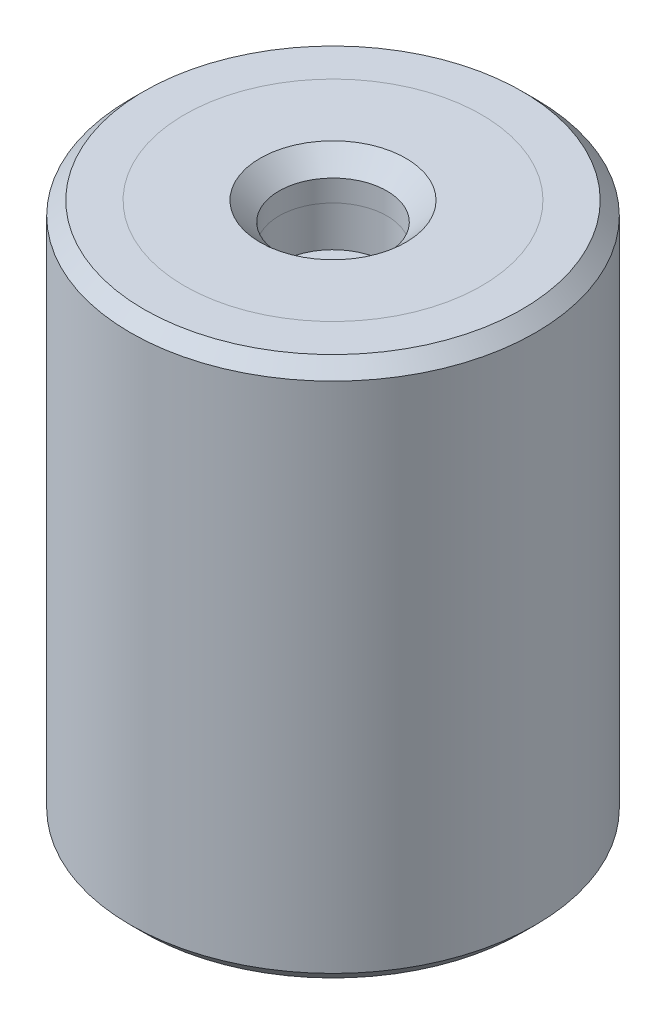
ISO-10303-21;
HEADER;
FILE_DESCRIPTION(('STEP AP214'),'2;1');
FILE_NAME('part.step','',(''),(''),'','','');
FILE_SCHEMA(('AUTOMOTIVE_DESIGN { 1 0 10303 214 1 1 1 1 }'));
ENDSEC;
DATA;
#1=APPLICATION_CONTEXT('core data for automotive mechanical design processes');
#2=APPLICATION_PROTOCOL_DEFINITION('international standard','automotive_design',2000,#1);
#3=PRODUCT_CONTEXT('',#1,'mechanical');
#4=PRODUCT('Part','Part','',(#3));
#5=PRODUCT_RELATED_PRODUCT_CATEGORY('part','',(#4));
#6=PRODUCT_DEFINITION_FORMATION('','',#4);
#7=PRODUCT_DEFINITION_CONTEXT('part definition',#1,'design');
#8=PRODUCT_DEFINITION('design','',#6,#7);
#9=PRODUCT_DEFINITION_SHAPE('','',#8);
#10=(LENGTH_UNIT() NAMED_UNIT(*) SI_UNIT(.MILLI.,.METRE.));
#11=(NAMED_UNIT(*) PLANE_ANGLE_UNIT() SI_UNIT($,.RADIAN.));
#12=(NAMED_UNIT(*) SI_UNIT($,.STERADIAN.) SOLID_ANGLE_UNIT());
#13=UNCERTAINTY_MEASURE_WITH_UNIT(LENGTH_MEASURE(1.E-05),#10,'distance_accuracy_value','');
#14=(GEOMETRIC_REPRESENTATION_CONTEXT(3) GLOBAL_UNCERTAINTY_ASSIGNED_CONTEXT((#13)) GLOBAL_UNIT_ASSIGNED_CONTEXT((#10,
#11,#12)) REPRESENTATION_CONTEXT('',''));
#15=CARTESIAN_POINT('',(0.,0.,0.));
#16=DIRECTION('',(0.,0.,1.));
#17=DIRECTION('',(1.,0.,0.));
#18=AXIS2_PLACEMENT_3D('',#15,#16,#17);
#19=CARTESIAN_POINT('',(0.,51.0340428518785,0.));
#20=DIRECTION('',(0.,1.,0.));
#21=DIRECTION('',(0.,0.,1.));
#22=AXIS2_PLACEMENT_3D('',#19,#20,#21);
#23=CYLINDRICAL_SURFACE('',#22,2.);
#24=CARTESIAN_POINT('',(0.,-17.8,0.));
#25=DIRECTION('',(0.,-1.,0.));
#26=DIRECTION('',(0.,0.,-1.));
#27=AXIS2_PLACEMENT_3D('',#24,#25,#26);
#28=CIRCLE('',#27,2.);
#29=CARTESIAN_POINT('',(0.,-17.8,-2.));
#30=VERTEX_POINT('',#29);
#31=EDGE_CURVE('P0_E10',#30,#30,#28,.T.);
#32=ORIENTED_EDGE('',*,*,#31,.T.);
#33=EDGE_LOOP('',(#32));
#34=FACE_BOUND('',#33,.T.);
#35=CARTESIAN_POINT('',(0.,-17.,0.));
#36=DIRECTION('',(0.,1.,0.));
#37=DIRECTION('',(0.,0.,1.));
#38=AXIS2_PLACEMENT_3D('',#35,#36,#37);
#39=CIRCLE('',#38,2.);
#40=CARTESIAN_POINT('',(0.,-17.,2.));
#41=VERTEX_POINT('',#40);
#42=EDGE_CURVE('P0_E25',#41,#41,#39,.T.);
#43=ORIENTED_EDGE('',*,*,#42,.T.);
#44=EDGE_LOOP('',(#43));
#45=FACE_BOUND('',#44,.T.);
#46=ADVANCED_FACE('P0_F14',(#34,#45),#23,.F.);
#47=CARTESIAN_POINT('',(0.,-17.,2.));
#48=DIRECTION('',(0.,1.,0.));
#49=DIRECTION('',(0.,0.,1.));
#50=AXIS2_PLACEMENT_3D('',#47,#48,#49);
#51=PLANE('',#50);
#52=CARTESIAN_POINT('',(0.,-17.,0.));
#53=DIRECTION('',(0.,1.,0.));
#54=DIRECTION('',(0.,0.,1.));
#55=AXIS2_PLACEMENT_3D('',#52,#53,#54);
#56=CIRCLE('',#55,5.5);
#57=CARTESIAN_POINT('',(0.,-17.,5.5));
#58=VERTEX_POINT('',#57);
#59=EDGE_CURVE('P0_E29',#58,#58,#56,.T.);
#60=ORIENTED_EDGE('',*,*,#59,.T.);
#61=EDGE_LOOP('',(#60));
#62=FACE_BOUND('',#61,.T.);
#63=ORIENTED_EDGE('',*,*,#42,.F.);
#64=EDGE_LOOP('',(#63));
#65=FACE_BOUND('',#64,.T.);
#66=ADVANCED_FACE('P0_F50',(#62,#65),#51,.T.);
#67=CARTESIAN_POINT('',(0.,51.0340428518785,0.));
#68=DIRECTION('',(0.,1.,0.));
#69=DIRECTION('',(0.,0.,1.));
#70=AXIS2_PLACEMENT_3D('',#67,#68,#69);
#71=CYLINDRICAL_SURFACE('',#70,5.5);
#72=CARTESIAN_POINT('',(0.,-18.5,0.));
#73=DIRECTION('',(0.,1.,0.));
#74=DIRECTION('',(0.,0.,1.));
#75=AXIS2_PLACEMENT_3D('',#72,#73,#74);
#76=CIRCLE('',#75,5.5);
#77=CARTESIAN_POINT('',(0.,-18.5,5.5));
#78=VERTEX_POINT('',#77);
#79=EDGE_CURVE('P0_E34',#78,#78,#76,.T.);
#80=ORIENTED_EDGE('',*,*,#79,.T.);
#81=EDGE_LOOP('',(#80));
#82=FACE_BOUND('',#81,.T.);
#83=ORIENTED_EDGE('',*,*,#59,.F.);
#84=EDGE_LOOP('',(#83));
#85=FACE_BOUND('',#84,.T.);
#86=ADVANCED_FACE('P0_F38',(#82,#85),#71,.T.);
#87=CARTESIAN_POINT('',(0.,-18.5,5.5));
#88=DIRECTION('',(0.,-1.,0.));
#89=DIRECTION('',(0.,0.,-1.));
#90=AXIS2_PLACEMENT_3D('',#87,#88,#89);
#91=PLANE('',#90);
#92=CARTESIAN_POINT('',(0.,-18.5,0.));
#93=DIRECTION('',(0.,-1.,0.));
#94=DIRECTION('',(0.,0.,-1.));
#95=AXIS2_PLACEMENT_3D('',#92,#93,#94);
#96=CIRCLE('',#95,2.7);
#97=CARTESIAN_POINT('',(0.,-18.5,-2.7));
#98=VERTEX_POINT('',#97);
#99=EDGE_CURVE('P0_E21',#98,#98,#96,.F.);
#100=ORIENTED_EDGE('',*,*,#99,.T.);
#101=EDGE_LOOP('',(#100));
#102=FACE_BOUND('',#101,.T.);
#103=ORIENTED_EDGE('',*,*,#79,.F.);
#104=EDGE_LOOP('',(#103));
#105=FACE_BOUND('',#104,.T.);
#106=ADVANCED_FACE('P0_F41',(#102,#105),#91,.T.);
#107=CARTESIAN_POINT('',(0.,-18.5,0.));
#108=DIRECTION('',(0.,-1.,0.));
#109=DIRECTION('',(0.,0.,-1.));
#110=AXIS2_PLACEMENT_3D('',#107,#108,#109);
#111=CONICAL_SURFACE('',#110,2.7,0.785398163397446);
#112=ORIENTED_EDGE('',*,*,#31,.F.);
#113=EDGE_LOOP('',(#112));
#114=FACE_BOUND('',#113,.T.);
#115=ORIENTED_EDGE('',*,*,#99,.F.);
#116=EDGE_LOOP('',(#115));
#117=FACE_BOUND('',#116,.T.);
#118=ADVANCED_FACE('P0_F16',(#114,#117),#111,.F.);
#119=CLOSED_SHELL('',(#46,#66,#86,#106,#118));
#120=MANIFOLD_SOLID_BREP('P0_B1',#119);
#121=CARTESIAN_POINT('',(0.,69.5340428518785,0.));
#122=DIRECTION('',(0.,1.,0.));
#123=DIRECTION('',(0.,0.,1.));
#124=AXIS2_PLACEMENT_3D('',#121,#122,#123);
#125=CYLINDRICAL_SURFACE('',#124,2.);
#126=CARTESIAN_POINT('',(0.,0.800000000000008,0.));
#127=DIRECTION('',(0.,1.,0.));
#128=DIRECTION('',(0.,0.,1.));
#129=AXIS2_PLACEMENT_3D('',#126,#127,#128);
#130=CIRCLE('',#129,2.);
#131=CARTESIAN_POINT('',(0.,0.800000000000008,2.));
#132=VERTEX_POINT('',#131);
#133=EDGE_CURVE('P1_E21',#132,#132,#130,.T.);
#134=ORIENTED_EDGE('',*,*,#133,.T.);
#135=EDGE_LOOP('',(#134));
#136=FACE_BOUND('',#135,.T.);
#137=CARTESIAN_POINT('',(0.,0.,0.));
#138=DIRECTION('',(0.,1.,0.));
#139=DIRECTION('',(0.,0.,1.));
#140=AXIS2_PLACEMENT_3D('',#137,#138,#139);
#141=CIRCLE('',#140,2.);
#142=CARTESIAN_POINT('',(0.,0.,2.));
#143=VERTEX_POINT('',#142);
#144=EDGE_CURVE('P1_E34',#143,#143,#141,.T.);
#145=ORIENTED_EDGE('',*,*,#144,.F.);
#146=EDGE_LOOP('',(#145));
#147=FACE_BOUND('',#146,.T.);
#148=ADVANCED_FACE('P1_F14',(#136,#147),#125,.F.);
#149=CARTESIAN_POINT('',(0.,1.5,2.));
#150=DIRECTION('',(0.,1.,0.));
#151=DIRECTION('',(0.,0.,1.));
#152=AXIS2_PLACEMENT_3D('',#149,#150,#151);
#153=PLANE('',#152);
#154=CARTESIAN_POINT('',(0.,1.5,0.));
#155=DIRECTION('',(0.,1.,0.));
#156=DIRECTION('',(0.,0.,1.));
#157=AXIS2_PLACEMENT_3D('',#154,#155,#156);
#158=CIRCLE('',#157,2.7);
#159=CARTESIAN_POINT('',(0.,1.5,2.7));
#160=VERTEX_POINT('',#159);
#161=EDGE_CURVE('P1_E10',#160,#160,#158,.F.);
#162=ORIENTED_EDGE('',*,*,#161,.T.);
#163=EDGE_LOOP('',(#162));
#164=FACE_BOUND('',#163,.T.);
#165=CARTESIAN_POINT('',(0.,1.5,0.));
#166=DIRECTION('',(0.,1.,0.));
#167=DIRECTION('',(0.,0.,1.));
#168=AXIS2_PLACEMENT_3D('',#165,#166,#167);
#169=CIRCLE('',#168,5.5);
#170=CARTESIAN_POINT('',(0.,1.5,5.5));
#171=VERTEX_POINT('',#170);
#172=EDGE_CURVE('P1_E25',#171,#171,#169,.T.);
#173=ORIENTED_EDGE('',*,*,#172,.T.);
#174=EDGE_LOOP('',(#173));
#175=FACE_BOUND('',#174,.T.);
#176=ADVANCED_FACE('P1_F42',(#164,#175),#153,.T.);
#177=CARTESIAN_POINT('',(0.,69.5340428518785,0.));
#178=DIRECTION('',(0.,1.,0.));
#179=DIRECTION('',(0.,0.,1.));
#180=AXIS2_PLACEMENT_3D('',#177,#178,#179);
#181=CYLINDRICAL_SURFACE('',#180,5.5);
#182=CARTESIAN_POINT('',(0.,0.,0.));
#183=DIRECTION('',(0.,1.,0.));
#184=DIRECTION('',(0.,0.,1.));
#185=AXIS2_PLACEMENT_3D('',#182,#183,#184);
#186=CIRCLE('',#185,5.5);
#187=CARTESIAN_POINT('',(0.,0.,5.5));
#188=VERTEX_POINT('',#187);
#189=EDGE_CURVE('P1_E29',#188,#188,#186,.T.);
#190=ORIENTED_EDGE('',*,*,#189,.T.);
#191=EDGE_LOOP('',(#190));
#192=FACE_BOUND('',#191,.T.);
#193=ORIENTED_EDGE('',*,*,#172,.F.);
#194=EDGE_LOOP('',(#193));
#195=FACE_BOUND('',#194,.T.);
#196=ADVANCED_FACE('P1_F47',(#192,#195),#181,.T.);
#197=CARTESIAN_POINT('',(0.,0.,5.5));
#198=DIRECTION('',(0.,-1.,0.));
#199=DIRECTION('',(0.,0.,-1.));
#200=AXIS2_PLACEMENT_3D('',#197,#198,#199);
#201=PLANE('',#200);
#202=ORIENTED_EDGE('',*,*,#144,.T.);
#203=EDGE_LOOP('',(#202));
#204=FACE_BOUND('',#203,.T.);
#205=ORIENTED_EDGE('',*,*,#189,.F.);
#206=EDGE_LOOP('',(#205));
#207=FACE_BOUND('',#206,.T.);
#208=ADVANCED_FACE('P1_F38',(#204,#207),#201,.T.);
#209=CARTESIAN_POINT('',(0.,0.800000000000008,0.));
#210=DIRECTION('',(0.,1.,0.));
#211=DIRECTION('',(0.,0.,1.));
#212=AXIS2_PLACEMENT_3D('',#209,#210,#211);
#213=CONICAL_SURFACE('',#212,2.,0.785398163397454);
#214=ORIENTED_EDGE('',*,*,#161,.F.);
#215=EDGE_LOOP('',(#214));
#216=FACE_BOUND('',#215,.T.);
#217=ORIENTED_EDGE('',*,*,#133,.F.);
#218=EDGE_LOOP('',(#217));
#219=FACE_BOUND('',#218,.T.);
#220=ADVANCED_FACE('P1_F16',(#216,#219),#213,.F.);
#221=CLOSED_SHELL('',(#148,#176,#196,#208,#220));
#222=MANIFOLD_SOLID_BREP('P1_B1',#221);
#223=CARTESIAN_POINT('',(0.,0.,0.));
#224=DIRECTION('',(0.,1.,0.));
#225=DIRECTION('',(0.,0.,1.));
#226=AXIS2_PLACEMENT_3D('',#223,#224,#225);
#227=PLANE('',#226);
#228=CARTESIAN_POINT('',(0.,0.,0.));
#229=DIRECTION('',(0.,1.,0.));
#230=DIRECTION('',(0.,0.,1.));
#231=AXIS2_PLACEMENT_3D('',#228,#229,#230);
#232=CIRCLE('',#231,2.);
#233=CARTESIAN_POINT('',(0.,0.,2.));
#234=VERTEX_POINT('',#233);
#235=EDGE_CURVE('P2_E46',#234,#234,#232,.T.);
#236=ORIENTED_EDGE('',*,*,#235,.F.);
#237=EDGE_LOOP('',(#236));
#238=FACE_BOUND('',#237,.T.);
#239=CARTESIAN_POINT('',(0.,0.,0.));
#240=DIRECTION('',(0.,1.,0.));
#241=DIRECTION('',(0.,0.,1.));
#242=AXIS2_PLACEMENT_3D('',#239,#240,#241);
#243=CIRCLE('',#242,5.5);
#244=CARTESIAN_POINT('',(0.,0.,5.5));
#245=VERTEX_POINT('',#244);
#246=EDGE_CURVE('P2_E33',#245,#245,#243,.T.);
#247=ORIENTED_EDGE('',*,*,#246,.T.);
#248=EDGE_LOOP('',(#247));
#249=FACE_BOUND('',#248,.T.);
#250=ADVANCED_FACE('P2_F13',(#238,#249),#227,.T.);
#251=CARTESIAN_POINT('',(0.,65.5134936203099,0.));
#252=DIRECTION('',(0.,1.,0.));
#253=DIRECTION('',(0.,0.,1.));
#254=AXIS2_PLACEMENT_3D('',#251,#252,#253);
#255=CYLINDRICAL_SURFACE('',#254,5.5);
#256=CARTESIAN_POINT('',(0.,1.5,0.));
#257=DIRECTION('',(0.,1.,0.));
#258=DIRECTION('',(0.,0.,1.));
#259=AXIS2_PLACEMENT_3D('',#256,#257,#258);
#260=CIRCLE('',#259,5.5);
#261=CARTESIAN_POINT('',(0.,1.5,5.5));
#262=VERTEX_POINT('',#261);
#263=EDGE_CURVE('P2_E36',#262,#262,#260,.T.);
#264=ORIENTED_EDGE('',*,*,#263,.T.);
#265=EDGE_LOOP('',(#264));
#266=FACE_BOUND('',#265,.T.);
#267=ORIENTED_EDGE('',*,*,#246,.F.);
#268=EDGE_LOOP('',(#267));
#269=FACE_BOUND('',#268,.T.);
#270=ADVANCED_FACE('P2_F92',(#266,#269),#255,.F.);
#271=CARTESIAN_POINT('',(0.,1.5,5.5));
#272=DIRECTION('',(0.,1.,0.));
#273=DIRECTION('',(0.,0.,1.));
#274=AXIS2_PLACEMENT_3D('',#271,#272,#273);
#275=PLANE('',#274);
#276=CARTESIAN_POINT('',(0.,1.5,0.));
#277=DIRECTION('',(0.,1.,0.));
#278=DIRECTION('',(0.,0.,1.));
#279=AXIS2_PLACEMENT_3D('',#276,#277,#278);
#280=CIRCLE('',#279,7.);
#281=CARTESIAN_POINT('',(0.,1.5,7.));
#282=VERTEX_POINT('',#281);
#283=EDGE_CURVE('P2_E9',#282,#282,#280,.T.);
#284=ORIENTED_EDGE('',*,*,#283,.T.);
#285=EDGE_LOOP('',(#284));
#286=FACE_BOUND('',#285,.T.);
#287=ORIENTED_EDGE('',*,*,#263,.F.);
#288=EDGE_LOOP('',(#287));
#289=FACE_BOUND('',#288,.T.);
#290=ADVANCED_FACE('P2_F88',(#286,#289),#275,.T.);
#291=CARTESIAN_POINT('',(0.,65.5134936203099,0.));
#292=DIRECTION('',(0.,1.,0.));
#293=DIRECTION('',(0.,0.,1.));
#294=AXIS2_PLACEMENT_3D('',#291,#292,#293);
#295=CYLINDRICAL_SURFACE('',#294,7.5);
#296=CARTESIAN_POINT('',(0.,-18.,0.));
#297=DIRECTION('',(0.,-1.,0.));
#298=DIRECTION('',(0.,0.,-1.));
#299=AXIS2_PLACEMENT_3D('',#296,#297,#298);
#300=CIRCLE('',#299,7.5);
#301=CARTESIAN_POINT('',(0.,-18.,-7.5));
#302=VERTEX_POINT('',#301);
#303=EDGE_CURVE('P2_E24',#302,#302,#300,.F.);
#304=ORIENTED_EDGE('',*,*,#303,.T.);
#305=EDGE_LOOP('',(#304));
#306=FACE_BOUND('',#305,.T.);
#307=CARTESIAN_POINT('',(0.,0.999999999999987,0.));
#308=DIRECTION('',(0.,1.,0.));
#309=DIRECTION('',(0.,0.,1.));
#310=AXIS2_PLACEMENT_3D('',#307,#308,#309);
#311=CIRCLE('',#310,7.5);
#312=CARTESIAN_POINT('',(0.,0.999999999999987,7.5));
#313=VERTEX_POINT('',#312);
#314=EDGE_CURVE('P2_E28',#313,#313,#311,.F.);
#315=ORIENTED_EDGE('',*,*,#314,.T.);
#316=EDGE_LOOP('',(#315));
#317=FACE_BOUND('',#316,.T.);
#318=ADVANCED_FACE('P2_F82',(#306,#317),#295,.T.);
#319=CARTESIAN_POINT('',(0.,-18.5,7.5));
#320=DIRECTION('',(0.,-1.,0.));
#321=DIRECTION('',(0.,0.,-1.));
#322=AXIS2_PLACEMENT_3D('',#319,#320,#321);
#323=PLANE('',#322);
#324=CARTESIAN_POINT('',(0.,-18.5,0.));
#325=DIRECTION('',(0.,-1.,0.));
#326=DIRECTION('',(0.,0.,-1.));
#327=AXIS2_PLACEMENT_3D('',#324,#325,#326);
#328=CIRCLE('',#327,7.);
#329=CARTESIAN_POINT('',(0.,-18.5,-7.));
#330=VERTEX_POINT('',#329);
#331=EDGE_CURVE('P2_E20',#330,#330,#328,.T.);
#332=ORIENTED_EDGE('',*,*,#331,.T.);
#333=EDGE_LOOP('',(#332));
#334=FACE_BOUND('',#333,.T.);
#335=CARTESIAN_POINT('',(0.,-18.5,0.));
#336=DIRECTION('',(0.,1.,0.));
#337=DIRECTION('',(0.,0.,1.));
#338=AXIS2_PLACEMENT_3D('',#335,#336,#337);
#339=CIRCLE('',#338,5.49999999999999);
#340=CARTESIAN_POINT('',(0.,-18.5,5.49999999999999));
#341=VERTEX_POINT('',#340);
#342=EDGE_CURVE('P2_E39',#341,#341,#339,.T.);
#343=ORIENTED_EDGE('',*,*,#342,.T.);
#344=EDGE_LOOP('',(#343));
#345=FACE_BOUND('',#344,.T.);
#346=ADVANCED_FACE('P2_F77',(#334,#345),#323,.T.);
#347=CARTESIAN_POINT('',(0.,65.5134936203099,0.));
#348=DIRECTION('',(0.,1.,0.));
#349=DIRECTION('',(0.,0.,1.));
#350=AXIS2_PLACEMENT_3D('',#347,#348,#349);
#351=CYLINDRICAL_SURFACE('',#350,5.49999999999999);
#352=CARTESIAN_POINT('',(0.,-17.,0.));
#353=DIRECTION('',(0.,1.,0.));
#354=DIRECTION('',(0.,0.,1.));
#355=AXIS2_PLACEMENT_3D('',#352,#353,#354);
#356=CIRCLE('',#355,5.49999999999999);
#357=CARTESIAN_POINT('',(0.,-17.,5.49999999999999));
#358=VERTEX_POINT('',#357);
#359=EDGE_CURVE('P2_E42',#358,#358,#356,.T.);
#360=ORIENTED_EDGE('',*,*,#359,.T.);
#361=EDGE_LOOP('',(#360));
#362=FACE_BOUND('',#361,.T.);
#363=ORIENTED_EDGE('',*,*,#342,.F.);
#364=EDGE_LOOP('',(#363));
#365=FACE_BOUND('',#364,.T.);
#366=ADVANCED_FACE('P2_F71',(#362,#365),#351,.F.);
#367=CARTESIAN_POINT('',(0.,-17.,5.49999999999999));
#368=DIRECTION('',(0.,-1.,0.));
#369=DIRECTION('',(0.,0.,-1.));
#370=AXIS2_PLACEMENT_3D('',#367,#368,#369);
#371=PLANE('',#370);
#372=CARTESIAN_POINT('',(0.,-17.,0.));
#373=DIRECTION('',(0.,-1.,0.));
#374=DIRECTION('',(0.,0.,-1.));
#375=AXIS2_PLACEMENT_3D('',#372,#373,#374);
#376=CIRCLE('',#375,2.);
#377=CARTESIAN_POINT('',(0.,-17.,-2.));
#378=VERTEX_POINT('',#377);
#379=EDGE_CURVE('P2_E52',#378,#378,#376,.T.);
#380=ORIENTED_EDGE('',*,*,#379,.F.);
#381=EDGE_LOOP('',(#380));
#382=FACE_BOUND('',#381,.T.);
#383=ORIENTED_EDGE('',*,*,#359,.F.);
#384=EDGE_LOOP('',(#383));
#385=FACE_BOUND('',#384,.T.);
#386=ADVANCED_FACE('P2_F67',(#382,#385),#371,.T.);
#387=CARTESIAN_POINT('',(0.,-18.,0.));
#388=DIRECTION('',(0.,1.,0.));
#389=DIRECTION('',(0.,0.,1.));
#390=AXIS2_PLACEMENT_3D('',#387,#388,#389);
#391=CONICAL_SURFACE('',#390,7.5,0.785398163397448);
#392=ORIENTED_EDGE('',*,*,#331,.F.);
#393=EDGE_LOOP('',(#392));
#394=FACE_BOUND('',#393,.T.);
#395=ORIENTED_EDGE('',*,*,#303,.F.);
#396=EDGE_LOOP('',(#395));
#397=FACE_BOUND('',#396,.T.);
#398=ADVANCED_FACE('P2_F70',(#394,#397),#391,.T.);
#399=CARTESIAN_POINT('',(0.,1.5,0.));
#400=DIRECTION('',(0.,-1.,0.));
#401=DIRECTION('',(0.,0.,-1.));
#402=AXIS2_PLACEMENT_3D('',#399,#400,#401);
#403=CONICAL_SURFACE('',#402,7.,0.785398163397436);
#404=ORIENTED_EDGE('',*,*,#314,.F.);
#405=EDGE_LOOP('',(#404));
#406=FACE_BOUND('',#405,.T.);
#407=ORIENTED_EDGE('',*,*,#283,.F.);
#408=EDGE_LOOP('',(#407));
#409=FACE_BOUND('',#408,.T.);
#410=ADVANCED_FACE('P2_F15',(#406,#409),#403,.T.);
#411=CARTESIAN_POINT('',(0.,-1.5,0.));
#412=DIRECTION('',(0.,1.,0.));
#413=DIRECTION('',(0.,0.,1.));
#414=AXIS2_PLACEMENT_3D('',#411,#412,#413);
#415=CYLINDRICAL_SURFACE('',#414,2.);
#416=CARTESIAN_POINT('',(0.,-1.5,0.));
#417=DIRECTION('',(0.,1.,0.));
#418=DIRECTION('',(0.,0.,1.));
#419=AXIS2_PLACEMENT_3D('',#416,#417,#418);
#420=CIRCLE('',#419,2.);
#421=CARTESIAN_POINT('',(0.,-1.5,2.));
#422=VERTEX_POINT('',#421);
#423=EDGE_CURVE('P2_E45',#422,#422,#420,.T.);
#424=ORIENTED_EDGE('',*,*,#423,.F.);
#425=EDGE_LOOP('',(#424));
#426=FACE_BOUND('',#425,.T.);
#427=ORIENTED_EDGE('',*,*,#235,.T.);
#428=EDGE_LOOP('',(#427));
#429=FACE_BOUND('',#428,.T.);
#430=ADVANCED_FACE('P2_F108',(#426,#429),#415,.F.);
#431=CARTESIAN_POINT('',(0.,-1.5,0.));
#432=DIRECTION('',(0.,1.,0.));
#433=DIRECTION('',(0.,0.,1.));
#434=AXIS2_PLACEMENT_3D('',#431,#432,#433);
#435=PLANE('',#434);
#436=ORIENTED_EDGE('',*,*,#423,.T.);
#437=EDGE_LOOP('',(#436));
#438=FACE_BOUND('',#437,.T.);
#439=ADVANCED_FACE('P2_F63',(#438),#435,.T.);
#440=CARTESIAN_POINT('',(0.,-15.5,0.));
#441=DIRECTION('',(0.,-1.,0.));
#442=DIRECTION('',(0.,0.,-1.));
#443=AXIS2_PLACEMENT_3D('',#440,#441,#442);
#444=CYLINDRICAL_SURFACE('',#443,2.);
#445=CARTESIAN_POINT('',(0.,-15.5,0.));
#446=DIRECTION('',(0.,-1.,0.));
#447=DIRECTION('',(0.,0.,-1.));
#448=AXIS2_PLACEMENT_3D('',#445,#446,#447);
#449=CIRCLE('',#448,2.);
#450=CARTESIAN_POINT('',(0.,-15.5,-2.));
#451=VERTEX_POINT('',#450);
#452=EDGE_CURVE('P2_E49',#451,#451,#449,.T.);
#453=ORIENTED_EDGE('',*,*,#452,.F.);
#454=EDGE_LOOP('',(#453));
#455=FACE_BOUND('',#454,.T.);
#456=ORIENTED_EDGE('',*,*,#379,.T.);
#457=EDGE_LOOP('',(#456));
#458=FACE_BOUND('',#457,.T.);
#459=ADVANCED_FACE('P2_F60',(#455,#458),#444,.F.);
#460=CARTESIAN_POINT('',(0.,-15.5,0.));
#461=DIRECTION('',(0.,-1.,0.));
#462=DIRECTION('',(0.,0.,-1.));
#463=AXIS2_PLACEMENT_3D('',#460,#461,#462);
#464=PLANE('',#463);
#465=ORIENTED_EDGE('',*,*,#452,.T.);
#466=EDGE_LOOP('',(#465));
#467=FACE_BOUND('',#466,.T.);
#468=ADVANCED_FACE('P2_F58',(#467),#464,.T.);
#469=CLOSED_SHELL('',(#250,#270,#290,#318,#346,#366,#386,#398,#410,#430,#439,#459,#468));
#470=MANIFOLD_SOLID_BREP('P2_B1',#469);
#471=ADVANCED_BREP_SHAPE_REPRESENTATION('',(#18,#120,#222,#470),#14);
#472=SHAPE_DEFINITION_REPRESENTATION(#9,#471);
ENDSEC;
END-ISO-10303-21;
